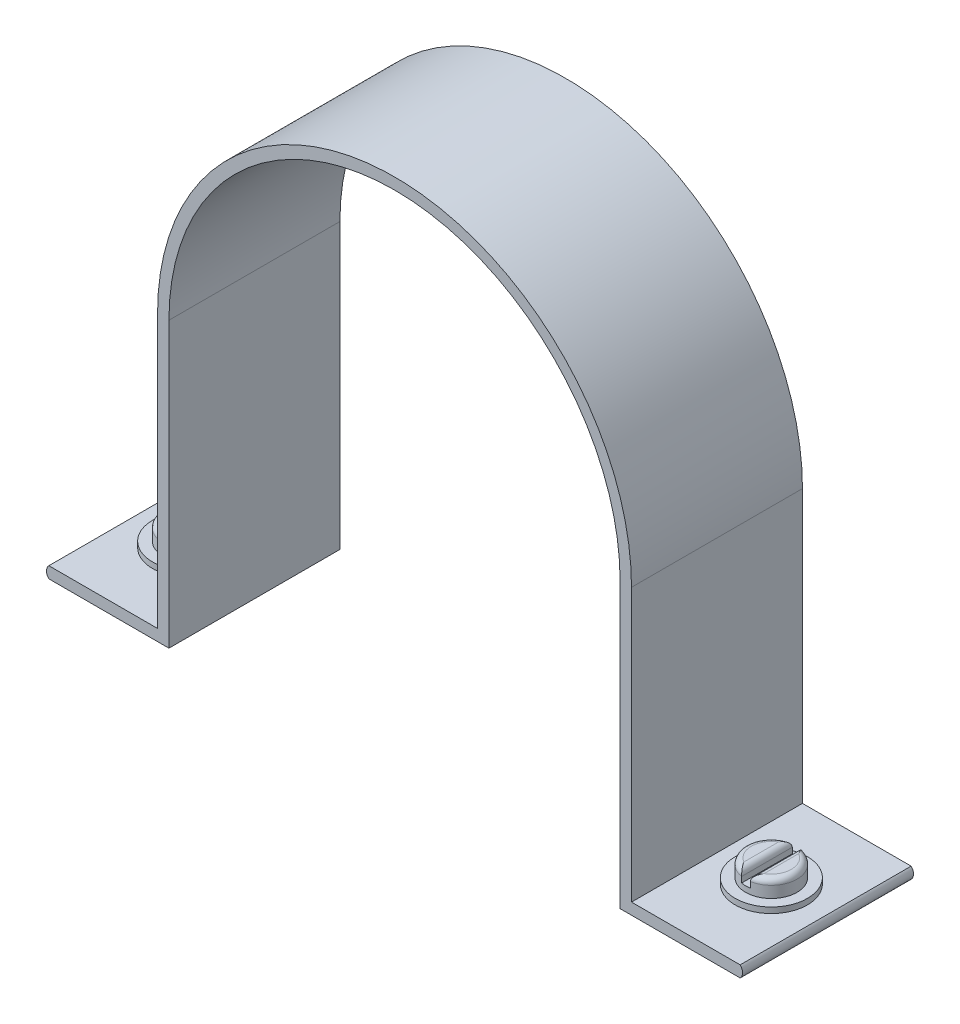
from build123d import *

# Parameters (mm, degrees)
BOSS_EXTRUDE1_DEPTH = 30
SKETCH2_R           = 6.337188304
BOSS_EXTRUDE2_DEPTH = 1
SKETCH3_R           = 4.51164734
BOSS_EXTRUDE3_DEPTH = 3
CUT_EXTRUDE1_DEPTH  = 2
FILLET1_R           = 1
FILLET2_R           = 1


with BuildPart() as part:
    # Sketch1 → Boss-Extrude1 (new body)
    with BuildSketch(Plane.XY):
        with BuildLine():
            Line((-39.583811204, 2), (-39.583811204, -47.838376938))
            Line((-39.583811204, -47.838376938), (-60.653415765, -47.838376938))
            ThreePointArc((-60.653415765, -47.838376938), (-61.067629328, -46.838376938), (-60.653415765, -45.838376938))
            Line((-60.653415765, -45.838376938), (-41.583811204, -45.838376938))
            Line((-41.583811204, -45.838376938), (-41.583811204, 2))
            ThreePointArc((-41.583811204, 2), (0, 43.583811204), (41.583811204, 2))
            Line((41.583811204, 2), (41.583811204, -45.838376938))
            Line((41.583811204, -45.838376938), (60.653415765, -45.838376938))
            ThreePointArc((60.653415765, -45.838376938), (61.067629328, -46.838376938), (60.653415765, -47.838376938))
            Line((60.653415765, -47.838376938), (39.583811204, -47.838376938))
            Line((39.583811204, -47.838376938), (39.583811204, 2))
            ThreePointArc((39.583811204, 2), (0, 41.583811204), (-39.583811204, 2))
        make_face()
    extrude(amount=BOSS_EXTRUDE1_DEPTH)

    # Sketch2 → Boss-Extrude2 (add)
    with BuildSketch(Plane(origin=(0, -45.838376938, 0), x_dir=(1, 0, 0), z_dir=(0, 1, 0))):
        with Locations(Location((51.118613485, -15, 0), (0, 0, 90))):
            Circle(SKETCH2_R)
        with Locations(Location((-51.118613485, -15, 0), (0, 0, 90))):
            Circle(SKETCH2_R)
    extrude(amount=BOSS_EXTRUDE2_DEPTH)

    # Sketch3 → Boss-Extrude3 (add)
    with BuildSketch(Plane(origin=(0, -44.838376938, 0), x_dir=(1, 0, 0), z_dir=(0, 1, 0))):
        with Locations(Location((51.118613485, -15, 0), (0, 0, 270))):
            Circle(SKETCH3_R)
        with Locations(Location((-51.118613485, -15, 0), (0, 0, 90))):
            Circle(SKETCH3_R)
    extrude(amount=BOSS_EXTRUDE3_DEPTH)

    # Sketch4 → Cut-Extrude1 (cut)
    with BuildSketch(Plane(origin=(0, -41.838376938, 0), x_dir=(1, 0, 0), z_dir=(0, 1, 0))):
        with BuildLine():
            Line((51.886382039, -10.48835266), (51.886382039, -19.51164734))
            ThreePointArc((51.886382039, -19.51164734), (51.118613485, -20.279415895), (50.35084493, -19.51164734))
            Line((50.35084493, -19.51164734), (50.35084493, -10.48835266))
            ThreePointArc((50.35084493, -10.48835266), (51.118613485, -9.720584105), (51.886382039, -10.48835266))
        make_face()
        with BuildLine():
            Line((-51.886382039, -10.48835266), (-51.886382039, -19.51164734))
            ThreePointArc((-51.886382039, -19.51164734), (-51.118613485, -20.279415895), (-50.35084493, -19.51164734))
            Line((-50.35084493, -19.51164734), (-50.35084493, -10.48835266))
            ThreePointArc((-50.35084493, -10.48835266), (-51.118613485, -9.720584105), (-51.886382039, -10.48835266))
        make_face()
    extrude(amount=-CUT_EXTRUDE1_DEPTH, mode=Mode.SUBTRACT)

    # Fillet1
    fillet1_edges = [part.edges().sort_by_distance(p)[0] for p in [
        (55.630260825, -41.838376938, 15),
        (46.606966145, -41.838376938, 15),
        (50.35084493, -41.838376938, 15),
        (51.886382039, -41.838376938, 15),
    ]]
    fillet(fillet1_edges, radius=FILLET1_R)

    # Fillet2
    fillet2_edges = [part.edges().sort_by_distance(p)[0] for p in [
        (-55.630260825, -41.838376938, 15),
        (-46.606966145, -41.838376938, 15),
        (-51.886382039, -41.838376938, 15),
        (-50.35084493, -41.838376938, 15),
    ]]
    fillet(fillet2_edges, radius=FILLET2_R)


solid = part.part
